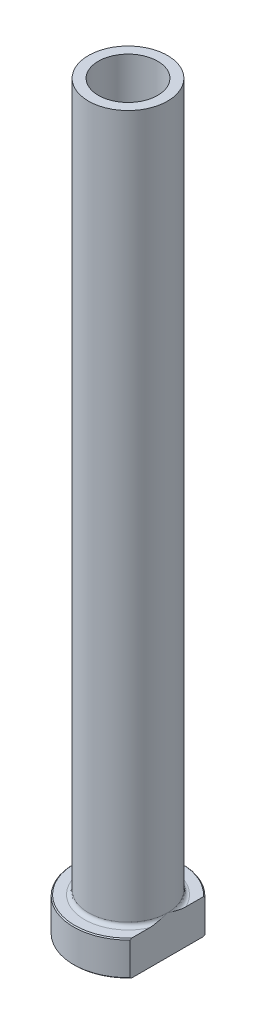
ISO-10303-21;
HEADER;
FILE_DESCRIPTION(('STEP AP214'),'2;1');
FILE_NAME('part.step','',(''),(''),'','','');
FILE_SCHEMA(('AUTOMOTIVE_DESIGN { 1 0 10303 214 1 1 1 1 }'));
ENDSEC;
DATA;
#1=APPLICATION_CONTEXT('core data for automotive mechanical design processes');
#2=APPLICATION_PROTOCOL_DEFINITION('international standard','automotive_design',2000,#1);
#3=PRODUCT_CONTEXT('',#1,'mechanical');
#4=PRODUCT('Part','Part','',(#3));
#5=PRODUCT_RELATED_PRODUCT_CATEGORY('part','',(#4));
#6=PRODUCT_DEFINITION_FORMATION('','',#4);
#7=PRODUCT_DEFINITION_CONTEXT('part definition',#1,'design');
#8=PRODUCT_DEFINITION('design','',#6,#7);
#9=PRODUCT_DEFINITION_SHAPE('','',#8);
#10=(LENGTH_UNIT() NAMED_UNIT(*) SI_UNIT(.MILLI.,.METRE.));
#11=(NAMED_UNIT(*) PLANE_ANGLE_UNIT() SI_UNIT($,.RADIAN.));
#12=(NAMED_UNIT(*) SI_UNIT($,.STERADIAN.) SOLID_ANGLE_UNIT());
#13=UNCERTAINTY_MEASURE_WITH_UNIT(LENGTH_MEASURE(1.E-05),#10,'distance_accuracy_value','');
#14=(GEOMETRIC_REPRESENTATION_CONTEXT(3) GLOBAL_UNCERTAINTY_ASSIGNED_CONTEXT((#13)) GLOBAL_UNIT_ASSIGNED_CONTEXT((#10,
#11,#12)) REPRESENTATION_CONTEXT('',''));
#15=CARTESIAN_POINT('',(0.,0.,0.));
#16=DIRECTION('',(0.,0.,1.));
#17=DIRECTION('',(1.,0.,0.));
#18=AXIS2_PLACEMENT_3D('',#15,#16,#17);
#19=CARTESIAN_POINT('',(0.,92.1876809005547,0.));
#20=DIRECTION('',(0.,1.,0.));
#21=DIRECTION('',(0.,0.,1.));
#22=AXIS2_PLACEMENT_3D('',#19,#20,#21);
#23=CYLINDRICAL_SURFACE('',#22,6.);
#24=CARTESIAN_POINT('',(0.,150.,0.));
#25=DIRECTION('',(0.,1.,0.));
#26=DIRECTION('',(0.,0.,1.));
#27=AXIS2_PLACEMENT_3D('',#24,#25,#26);
#28=CIRCLE('',#27,6.);
#29=CARTESIAN_POINT('',(0.,150.,6.));
#30=VERTEX_POINT('',#29);
#31=EDGE_CURVE('E167',#30,#30,#28,.T.);
#32=ORIENTED_EDGE('',*,*,#31,.T.);
#33=EDGE_LOOP('',(#32));
#34=FACE_BOUND('',#33,.T.);
#35=CARTESIAN_POINT('',(0.,95.,0.));
#36=DIRECTION('',(0.,1.,0.));
#37=DIRECTION('',(0.,0.,1.));
#38=AXIS2_PLACEMENT_3D('',#35,#36,#37);
#39=CIRCLE('',#38,6.);
#40=CARTESIAN_POINT('',(0.,95.,6.));
#41=VERTEX_POINT('',#40);
#42=EDGE_CURVE('E170',#41,#41,#39,.T.);
#43=ORIENTED_EDGE('',*,*,#42,.F.);
#44=EDGE_LOOP('',(#43));
#45=FACE_BOUND('',#44,.T.);
#46=ADVANCED_FACE('F32',(#34,#45),#23,.F.);
#47=CARTESIAN_POINT('',(-6.,150.,0.));
#48=DIRECTION('',(0.,1.,0.));
#49=DIRECTION('',(0.,0.,1.));
#50=AXIS2_PLACEMENT_3D('',#47,#48,#49);
#51=PLANE('',#50);
#52=CARTESIAN_POINT('',(0.,150.,0.));
#53=DIRECTION('',(0.,1.,0.));
#54=DIRECTION('',(0.,0.,1.));
#55=AXIS2_PLACEMENT_3D('',#52,#53,#54);
#56=CIRCLE('',#55,8.00000000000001);
#57=CARTESIAN_POINT('',(0.,150.,8.00000000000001));
#58=VERTEX_POINT('',#57);
#59=EDGE_CURVE('E174',#58,#58,#56,.T.);
#60=ORIENTED_EDGE('',*,*,#59,.T.);
#61=EDGE_LOOP('',(#60));
#62=FACE_BOUND('',#61,.T.);
#63=ORIENTED_EDGE('',*,*,#31,.F.);
#64=EDGE_LOOP('',(#63));
#65=FACE_BOUND('',#64,.T.);
#66=ADVANCED_FACE('F157',(#62,#65),#51,.T.);
#67=CARTESIAN_POINT('',(0.,92.1876809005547,0.));
#68=DIRECTION('',(0.,1.,0.));
#69=DIRECTION('',(0.,0.,1.));
#70=AXIS2_PLACEMENT_3D('',#67,#68,#69);
#71=CYLINDRICAL_SURFACE('',#70,8.);
#72=CARTESIAN_POINT('',(0.,7.8,0.));
#73=DIRECTION('',(0.,1.,0.));
#74=DIRECTION('',(0.,0.,1.));
#75=AXIS2_PLACEMENT_3D('',#72,#73,#74);
#76=CIRCLE('',#75,8.);
#77=CARTESIAN_POINT('',(8.,7.8,0.));
#78=VERTEX_POINT('',#77);
#79=EDGE_CURVE('E180',#78,#78,#76,.T.);
#80=ORIENTED_EDGE('',*,*,#79,.T.);
#81=EDGE_LOOP('',(#80));
#82=FACE_BOUND('',#81,.T.);
#83=ORIENTED_EDGE('',*,*,#59,.F.);
#84=EDGE_LOOP('',(#83));
#85=FACE_BOUND('',#84,.T.);
#86=ADVANCED_FACE('F162',(#82,#85),#71,.T.);
#87=CARTESIAN_POINT('',(-7.99999999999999,7.,0.));
#88=DIRECTION('',(0.,1.,0.));
#89=DIRECTION('',(0.,0.,1.));
#90=AXIS2_PLACEMENT_3D('',#87,#88,#89);
#91=PLANE('',#90);
#92=DIRECTION('',(0.,0.,1.));
#93=VECTOR('',#92,1.);
#94=CARTESIAN_POINT('',(8.,7.,0.));
#95=LINE('',#94,#93);
#96=CARTESIAN_POINT('',(8.,7.,-7.25534285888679));
#97=VERTEX_POINT('',#96);
#98=CARTESIAN_POINT('',(8.,7.,-3.66606055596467));
#99=VERTEX_POINT('',#98);
#100=EDGE_CURVE('E54',#97,#99,#95,.T.);
#101=ORIENTED_EDGE('',*,*,#100,.F.);
#102=CARTESIAN_POINT('',(0.,7.,0.));
#103=DIRECTION('',(0.,1.,0.));
#104=DIRECTION('',(0.,0.,1.));
#105=AXIS2_PLACEMENT_3D('',#102,#103,#104);
#106=CIRCLE('',#105,10.8);
#107=CARTESIAN_POINT('',(8.,7.,7.2553428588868));
#108=VERTEX_POINT('',#107);
#109=EDGE_CURVE('E186',#97,#108,#106,.T.);
#110=ORIENTED_EDGE('',*,*,#109,.T.);
#111=CARTESIAN_POINT('',(8.,7.,3.66606055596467));
#112=VERTEX_POINT('',#111);
#113=EDGE_CURVE('E134',#112,#108,#95,.T.);
#114=ORIENTED_EDGE('',*,*,#113,.F.);
#115=CARTESIAN_POINT('',(0.,7.,0.));
#116=DIRECTION('',(0.,1.,0.));
#117=DIRECTION('',(0.,0.,1.));
#118=AXIS2_PLACEMENT_3D('',#115,#116,#117);
#119=CIRCLE('',#118,8.8);
#120=EDGE_CURVE('E183',#112,#99,#119,.F.);
#121=ORIENTED_EDGE('',*,*,#120,.T.);
#122=EDGE_LOOP('',(#101,#110,#114,#121));
#123=FACE_BOUND('',#122,.T.);
#124=ADVANCED_FACE('F197',(#123),#91,.T.);
#125=CARTESIAN_POINT('',(0.,92.1876809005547,0.));
#126=DIRECTION('',(0.,1.,0.));
#127=DIRECTION('',(0.,0.,1.));
#128=AXIS2_PLACEMENT_3D('',#125,#126,#127);
#129=CYLINDRICAL_SURFACE('',#128,11.);
#130=DIRECTION('',(0.,-1.,0.));
#131=VECTOR('',#130,1.);
#132=CARTESIAN_POINT('',(8.,150.,7.54983443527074));
#133=LINE('',#132,#131);
#134=CARTESIAN_POINT('',(8.,6.79999999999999,7.54983443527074));
#135=VERTEX_POINT('',#134);
#136=CARTESIAN_POINT('',(8.,0.200000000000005,7.54983443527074));
#137=VERTEX_POINT('',#136);
#138=EDGE_CURVE('E82',#135,#137,#133,.T.);
#139=ORIENTED_EDGE('',*,*,#138,.F.);
#140=CARTESIAN_POINT('',(0.,6.79999999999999,0.));
#141=DIRECTION('',(0.,1.,0.));
#142=DIRECTION('',(0.,0.,1.));
#143=AXIS2_PLACEMENT_3D('',#140,#141,#142);
#144=CIRCLE('',#143,11.);
#145=CARTESIAN_POINT('',(8.,6.79999999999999,-7.54983443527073));
#146=VERTEX_POINT('',#145);
#147=EDGE_CURVE('E95',#135,#146,#144,.F.);
#148=ORIENTED_EDGE('',*,*,#147,.T.);
#149=DIRECTION('',(0.,-1.,0.));
#150=VECTOR('',#149,1.);
#151=CARTESIAN_POINT('',(8.,150.,-7.54983443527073));
#152=LINE('',#151,#150);
#153=CARTESIAN_POINT('',(8.,0.200000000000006,-7.54983443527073));
#154=VERTEX_POINT('',#153);
#155=EDGE_CURVE('E192',#146,#154,#152,.T.);
#156=ORIENTED_EDGE('',*,*,#155,.T.);
#157=CARTESIAN_POINT('',(0.,0.200000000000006,0.));
#158=DIRECTION('',(0.,-1.,0.));
#159=DIRECTION('',(0.,0.,-1.));
#160=AXIS2_PLACEMENT_3D('',#157,#158,#159);
#161=CIRCLE('',#160,11.);
#162=EDGE_CURVE('E98',#154,#137,#161,.F.);
#163=ORIENTED_EDGE('',*,*,#162,.T.);
#164=EDGE_LOOP('',(#139,#148,#156,#163));
#165=FACE_BOUND('',#164,.T.);
#166=ADVANCED_FACE('F190',(#165),#129,.T.);
#167=CARTESIAN_POINT('',(-11.,0.,0.));
#168=DIRECTION('',(0.,-1.,0.));
#169=DIRECTION('',(0.,0.,-1.));
#170=AXIS2_PLACEMENT_3D('',#167,#168,#169);
#171=PLANE('',#170);
#172=CARTESIAN_POINT('',(0.,0.,0.));
#173=DIRECTION('',(0.,-1.,0.));
#174=DIRECTION('',(0.,0.,-1.));
#175=AXIS2_PLACEMENT_3D('',#172,#173,#174);
#176=CIRCLE('',#175,6.74999999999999);
#177=CARTESIAN_POINT('',(0.,0.,-6.74999999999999));
#178=VERTEX_POINT('',#177);
#179=EDGE_CURVE('E40',#178,#178,#176,.F.);
#180=ORIENTED_EDGE('',*,*,#179,.T.);
#181=EDGE_LOOP('',(#180));
#182=FACE_BOUND('',#181,.T.);
#183=DIRECTION('',(0.,0.,-1.));
#184=VECTOR('',#183,1.);
#185=CARTESIAN_POINT('',(8.,0.,7.54983443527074));
#186=LINE('',#185,#184);
#187=CARTESIAN_POINT('',(8.,0.,7.25534285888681));
#188=VERTEX_POINT('',#187);
#189=CARTESIAN_POINT('',(8.,0.,-7.25534285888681));
#190=VERTEX_POINT('',#189);
#191=EDGE_CURVE('E47',#188,#190,#186,.T.);
#192=ORIENTED_EDGE('',*,*,#191,.F.);
#193=CARTESIAN_POINT('',(0.,0.,0.));
#194=DIRECTION('',(0.,-1.,0.));
#195=DIRECTION('',(0.,0.,-1.));
#196=AXIS2_PLACEMENT_3D('',#193,#194,#195);
#197=CIRCLE('',#196,10.8);
#198=EDGE_CURVE('E92',#188,#190,#197,.T.);
#199=ORIENTED_EDGE('',*,*,#198,.T.);
#200=EDGE_LOOP('',(#192,#199));
#201=FACE_BOUND('',#200,.T.);
#202=ADVANCED_FACE('F91',(#182,#201),#171,.T.);
#203=CARTESIAN_POINT('',(0.,92.1876809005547,0.));
#204=DIRECTION('',(0.,1.,0.));
#205=DIRECTION('',(0.,0.,1.));
#206=AXIS2_PLACEMENT_3D('',#203,#204,#205);
#207=CYLINDRICAL_SURFACE('',#206,6.25);
#208=CARTESIAN_POINT('',(0.,0.499999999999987,0.));
#209=DIRECTION('',(0.,-1.,0.));
#210=DIRECTION('',(0.,0.,-1.));
#211=AXIS2_PLACEMENT_3D('',#208,#209,#210);
#212=CIRCLE('',#211,6.25);
#213=CARTESIAN_POINT('',(0.,0.499999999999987,-6.25));
#214=VERTEX_POINT('',#213);
#215=EDGE_CURVE('E11',#214,#214,#212,.T.);
#216=ORIENTED_EDGE('',*,*,#215,.T.);
#217=EDGE_LOOP('',(#216));
#218=FACE_BOUND('',#217,.T.);
#219=CARTESIAN_POINT('',(0.,83.,0.));
#220=DIRECTION('',(0.,1.,0.));
#221=DIRECTION('',(0.,0.,1.));
#222=AXIS2_PLACEMENT_3D('',#219,#220,#221);
#223=CIRCLE('',#222,6.25);
#224=CARTESIAN_POINT('',(0.,83.,6.25));
#225=VERTEX_POINT('',#224);
#226=EDGE_CURVE('E172',#225,#225,#223,.T.);
#227=ORIENTED_EDGE('',*,*,#226,.T.);
#228=EDGE_LOOP('',(#227));
#229=FACE_BOUND('',#228,.T.);
#230=ADVANCED_FACE('F215',(#218,#229),#207,.F.);
#231=CARTESIAN_POINT('',(0.,83.,0.));
#232=DIRECTION('',(0.,-1.,0.));
#233=DIRECTION('',(0.,0.,-1.));
#234=AXIS2_PLACEMENT_3D('',#231,#232,#233);
#235=CONICAL_SURFACE('',#234,6.25,0.0208303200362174);
#236=ORIENTED_EDGE('',*,*,#42,.T.);
#237=EDGE_LOOP('',(#236));
#238=FACE_BOUND('',#237,.T.);
#239=ORIENTED_EDGE('',*,*,#226,.F.);
#240=EDGE_LOOP('',(#239));
#241=FACE_BOUND('',#240,.T.);
#242=ADVANCED_FACE('F111',(#238,#241),#235,.F.);
#243=CARTESIAN_POINT('',(0.,7.8,0.));
#244=DIRECTION('',(0.,1.,0.));
#245=DIRECTION('',(0.,0.,1.));
#246=AXIS2_PLACEMENT_3D('',#243,#244,#245);
#247=TOROIDAL_SURFACE('',#246,8.8,0.8);
#248=ORIENTED_EDGE('',*,*,#120,.F.);
#249=CARTESIAN_POINT('',(8.,7.8,0.));
#250=CARTESIAN_POINT('',(8.,7.80000101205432,-1.09624618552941E-10));
#251=CARTESIAN_POINT('',(8.,7.80000202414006,2.93324102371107E-07));
#252=CARTESIAN_POINT('',(8.,7.80000394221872,1.16283092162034E-06));
#253=CARTESIAN_POINT('',(8.,7.80000483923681,1.75365137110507E-06));
#254=CARTESIAN_POINT('',(8.,7.80000665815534,3.16446778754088E-06));
#255=CARTESIAN_POINT('',(8.,7.80000756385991,4.00549161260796E-06));
#256=CARTESIAN_POINT('',(8.,7.80000923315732,5.783479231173E-06));
#257=CARTESIAN_POINT('',(8.,7.80000999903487,6.71842031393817E-06));
#258=CARTESIAN_POINT('',(8.,7.80001270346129,1.02037216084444E-05));
#259=CARTESIAN_POINT('',(8.,7.80001449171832,1.2874040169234E-05));
#260=CARTESIAN_POINT('',(8.,7.80001755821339,1.82727385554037E-05));
#261=CARTESIAN_POINT('',(8.,7.80001886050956,2.09881557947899E-05));
#262=CARTESIAN_POINT('',(8.,7.80002405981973,3.20647804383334E-05));
#263=CARTESIAN_POINT('',(8.,7.80002777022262,4.05225585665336E-05));
#264=CARTESIAN_POINT('',(8.,7.80003348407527,5.68037702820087E-05));
#265=CARTESIAN_POINT('',(8.,7.80003564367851,6.4572887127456E-05));
#266=CARTESIAN_POINT('',(8.,7.800050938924,0.000121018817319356));
#267=CARTESIAN_POINT('',(8.,7.80006211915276,0.000170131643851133));
#268=CARTESIAN_POINT('',(7.99999999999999,7.80011100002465,0.000362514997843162));
#269=CARTESIAN_POINT('',(8.,7.80015802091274,0.000503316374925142));
#270=CARTESIAN_POINT('',(8.00000000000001,7.80033939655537,0.00105711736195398));
#271=CARTESIAN_POINT('',(8.,7.80046737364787,0.00147161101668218));
#272=CARTESIAN_POINT('',(7.99999999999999,7.80097644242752,0.00310648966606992));
#273=CARTESIAN_POINT('',(7.99999999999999,7.80136531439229,0.00432501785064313));
#274=CARTESIAN_POINT('',(8.00000000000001,7.80297358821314,0.00937955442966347));
#275=CARTESIAN_POINT('',(8.,7.80418342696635,0.0132178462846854));
#276=CARTESIAN_POINT('',(7.99999999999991,7.82754122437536,0.0873020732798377));
#277=CARTESIAN_POINT('',(7.99999999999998,7.84979021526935,0.157524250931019));
#278=CARTESIAN_POINT('',(8.00000000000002,7.89322681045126,0.295235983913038));
#279=CARTESIAN_POINT('',(8.,7.91442151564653,0.362723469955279));
#280=CARTESIAN_POINT('',(7.99999999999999,7.9592343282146,0.506178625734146));
#281=CARTESIAN_POINT('',(8.,7.9828252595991,0.582154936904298));
#282=CARTESIAN_POINT('',(8.,8.02983069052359,0.735069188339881));
#283=CARTESIAN_POINT('',(8.,8.05324046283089,0.812008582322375));
#284=CARTESIAN_POINT('',(8.,8.09303795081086,0.94464550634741));
#285=CARTESIAN_POINT('',(8.,8.10956807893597,1.00030022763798));
#286=CARTESIAN_POINT('',(8.,8.14221289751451,1.11157683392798));
#287=CARTESIAN_POINT('',(8.,8.15832854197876,1.16719843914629));
#288=CARTESIAN_POINT('',(8.,8.20527739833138,1.33164052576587));
#289=CARTESIAN_POINT('',(8.,8.23549814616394,1.44063711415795));
#290=CARTESIAN_POINT('',(8.,8.29826335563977,1.67606835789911));
#291=CARTESIAN_POINT('',(8.,8.3304474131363,1.80259995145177));
#292=CARTESIAN_POINT('',(8.,8.39126396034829,2.05750030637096));
#293=CARTESIAN_POINT('',(8.,8.41986879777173,2.18587573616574));
#294=CARTESIAN_POINT('',(8.,8.47414203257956,2.4532187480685));
#295=CARTESIAN_POINT('',(8.,8.49943375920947,2.59226394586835));
#296=CARTESIAN_POINT('',(8.,8.54278750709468,2.87150561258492));
#297=CARTESIAN_POINT('',(8.,8.56085024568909,3.01170196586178));
#298=CARTESIAN_POINT('',(8.,8.58291287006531,3.24319459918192));
#299=CARTESIAN_POINT('',(8.,8.589627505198,3.33423069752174));
#300=CARTESIAN_POINT('',(8.,8.59844042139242,3.51651109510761));
#301=CARTESIAN_POINT('',(8.,8.60054027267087,3.60775531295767));
#302=CARTESIAN_POINT('',(8.,8.59923478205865,3.78855451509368));
#303=CARTESIAN_POINT('',(8.,8.59592927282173,3.87810991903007));
#304=CARTESIAN_POINT('',(8.,8.58288784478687,4.05671727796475));
#305=CARTESIAN_POINT('',(8.,8.57315718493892,4.14576958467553));
#306=CARTESIAN_POINT('',(8.,8.54786053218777,4.30910044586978));
#307=CARTESIAN_POINT('',(8.,8.53341905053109,4.38354919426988));
#308=CARTESIAN_POINT('',(8.,8.49747543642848,4.53120906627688));
#309=CARTESIAN_POINT('',(8.,8.47593618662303,4.60441150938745));
#310=CARTESIAN_POINT('',(8.,8.42376924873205,4.74853436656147));
#311=CARTESIAN_POINT('',(8.,8.39303920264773,4.81941853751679));
#312=CARTESIAN_POINT('',(8.,8.32008168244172,4.9549058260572));
#313=CARTESIAN_POINT('',(8.,8.27792970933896,5.01954653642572));
#314=CARTESIAN_POINT('',(8.,8.20692535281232,5.10354772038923));
#315=CARTESIAN_POINT('',(8.,8.1839783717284,5.1278859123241));
#316=CARTESIAN_POINT('',(8.,8.13503511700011,5.17336988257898));
#317=CARTESIAN_POINT('',(8.,8.10903727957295,5.19451401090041));
#318=CARTESIAN_POINT('',(8.,8.05362521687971,5.23266411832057));
#319=CARTESIAN_POINT('',(8.,8.02417247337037,5.2496152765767));
#320=CARTESIAN_POINT('',(8.,7.96255238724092,5.27751973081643));
#321=CARTESIAN_POINT('',(8.,7.93039220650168,5.28848831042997));
#322=CARTESIAN_POINT('',(8.,7.87282733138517,5.30129051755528));
#323=CARTESIAN_POINT('',(8.,7.84777777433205,5.3047353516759));
#324=CARTESIAN_POINT('',(8.,7.79745799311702,5.30730687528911));
#325=CARTESIAN_POINT('',(8.,7.77218785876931,5.30643524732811));
#326=CARTESIAN_POINT('',(8.,7.72220872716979,5.30045124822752));
#327=CARTESIAN_POINT('',(8.,7.69749884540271,5.29534612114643));
#328=CARTESIAN_POINT('',(8.,7.64919855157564,5.28130622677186));
#329=CARTESIAN_POINT('',(8.,7.62560888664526,5.27236894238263));
#330=CARTESIAN_POINT('',(8.,7.57186978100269,5.24749103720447));
#331=CARTESIAN_POINT('',(8.,7.54235117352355,5.2301914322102));
#332=CARTESIAN_POINT('',(8.,7.48647501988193,5.19107874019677));
#333=CARTESIAN_POINT('',(8.,7.46012476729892,5.16925554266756));
#334=CARTESIAN_POINT('',(8.,7.397581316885,5.11005232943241));
#335=CARTESIAN_POINT('',(8.,7.3634525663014,5.07050732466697));
#336=CARTESIAN_POINT('',(8.,7.30158414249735,4.98680536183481));
#337=CARTESIAN_POINT('',(8.,7.27385227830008,4.94264286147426));
#338=CARTESIAN_POINT('',(8.,7.22655631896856,4.85651446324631));
#339=CARTESIAN_POINT('',(8.,7.2064260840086,4.81485346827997));
#340=CARTESIAN_POINT('',(8.,7.16979237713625,4.72995016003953));
#341=CARTESIAN_POINT('',(8.,7.15329194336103,4.6867065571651));
#342=CARTESIAN_POINT('',(8.,7.1082475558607,4.55471342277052));
#343=CARTESIAN_POINT('',(8.,7.08448205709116,4.46433285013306));
#344=CARTESIAN_POINT('',(8.,7.04606817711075,4.27884520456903));
#345=CARTESIAN_POINT('',(8.,7.03172934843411,4.18367881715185));
#346=CARTESIAN_POINT('',(8.,7.01115182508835,3.99231790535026));
#347=CARTESIAN_POINT('',(8.,7.00492963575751,3.89612168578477));
#348=CARTESIAN_POINT('',(8.,6.99917472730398,3.7068320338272));
#349=CARTESIAN_POINT('',(8.,6.99942213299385,3.61374410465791));
#350=CARTESIAN_POINT('',(8.,7.00500334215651,3.42814181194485));
#351=CARTESIAN_POINT('',(8.,7.01031504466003,3.3356267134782));
#352=CARTESIAN_POINT('',(8.,7.02729273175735,3.12465235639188));
#353=CARTESIAN_POINT('',(8.,7.04033732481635,3.00630616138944));
#354=CARTESIAN_POINT('',(8.,7.07206018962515,2.77043320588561));
#355=CARTESIAN_POINT('',(8.,7.09073668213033,2.65290619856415));
#356=CARTESIAN_POINT('',(8.,7.13314336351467,2.4159831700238));
#357=CARTESIAN_POINT('',(8.,7.15698005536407,2.29660645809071));
#358=CARTESIAN_POINT('',(8.,7.2085650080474,2.05839418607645));
#359=CARTESIAN_POINT('',(8.,7.23632304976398,1.93956077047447));
#360=CARTESIAN_POINT('',(8.,7.30538420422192,1.6602675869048));
#361=CARTESIAN_POINT('',(8.,7.34797978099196,1.50012949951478));
#362=CARTESIAN_POINT('',(8.,7.43661699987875,1.18271330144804));
#363=CARTESIAN_POINT('',(8.,7.48261587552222,1.02542306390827));
#364=CARTESIAN_POINT('',(8.,7.55073856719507,0.798945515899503));
#365=CARTESIAN_POINT('',(8.,7.57189590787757,0.729464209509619));
#366=CARTESIAN_POINT('',(8.,7.6146616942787,0.590318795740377));
#367=CARTESIAN_POINT('',(8.,7.63627166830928,0.520655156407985));
#368=CARTESIAN_POINT('',(8.,7.68075896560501,0.378072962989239));
#369=CARTESIAN_POINT('',(8.00000000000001,7.70364749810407,0.305157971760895));
#370=CARTESIAN_POINT('',(7.99999999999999,7.74926260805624,0.160522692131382));
#371=CARTESIAN_POINT('',(7.99999999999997,7.77198614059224,0.0888015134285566));
#372=CARTESIAN_POINT('',(8.,7.79581756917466,0.0132146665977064));
#373=CARTESIAN_POINT('',(8.,7.79702841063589,0.00937319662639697));
#374=CARTESIAN_POINT('',(8.,7.7986369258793,0.00431792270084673));
#375=CARTESIAN_POINT('',(8.,7.7990250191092,0.00310183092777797));
#376=CARTESIAN_POINT('',(8.,7.79953313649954,0.00147000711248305));
#377=CARTESIAN_POINT('',(8.,7.79966092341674,0.00105612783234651));
#378=CARTESIAN_POINT('',(8.,7.79984206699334,0.000503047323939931));
#379=CARTESIAN_POINT('',(8.,7.79988905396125,0.000362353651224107));
#380=CARTESIAN_POINT('',(8.,7.79993790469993,0.000170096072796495));
#381=CARTESIAN_POINT('',(8.,7.79994908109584,0.000120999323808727));
#382=CARTESIAN_POINT('',(8.,7.79996436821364,6.45695800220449E-05));
#383=CARTESIAN_POINT('',(8.,7.79996652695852,5.68014469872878E-05));
#384=CARTESIAN_POINT('',(8.,7.7999722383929,4.05221695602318E-05));
#385=CARTESIAN_POINT('',(8.,7.79997594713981,3.20652918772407E-05));
#386=CARTESIAN_POINT('',(8.,7.79998114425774,2.09895698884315E-05));
#387=CARTESIAN_POINT('',(8.,7.79998244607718,1.8274226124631E-05));
#388=CARTESIAN_POINT('',(8.,7.7999855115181,1.28755885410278E-05));
#389=CARTESIAN_POINT('',(8.,7.79998729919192,1.02052498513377E-05));
#390=CARTESIAN_POINT('',(8.,7.79999000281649,6.71981854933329E-06));
#391=CARTESIAN_POINT('',(8.,7.79999076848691,5.78481784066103E-06));
#392=CARTESIAN_POINT('',(8.,7.79999243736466,4.00667365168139E-06));
#393=CARTESIAN_POINT('',(8.,7.79999334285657,3.16555205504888E-06));
#394=CARTESIAN_POINT('',(8.,7.79999516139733,1.75450218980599E-06));
#395=CARTESIAN_POINT('',(8.,7.79999605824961,1.16355303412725E-06));
#396=CARTESIAN_POINT('',(8.,7.79999797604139,2.93728190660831E-07));
#397=CARTESIAN_POINT('',(8.,7.79999898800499,1.096218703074E-10));
#398=CARTESIAN_POINT('',(8.,7.8,0.));
#399=B_SPLINE_CURVE_WITH_KNOTS('',3,(#249,#250,#251,#252,#253,#254,#255,#256,#257,#258,#259,
#260,#261,#262,#263,#264,#265,#266,#267,#268,#269,#270,#271,#272,#273,#274,#275,#276,#277,#278,
#279,#280,#281,#282,#283,#284,#285,#286,#287,#288,#289,#290,#291,#292,#293,#294,#295,#296,#297,
#298,#299,#300,#301,#302,#303,#304,#305,#306,#307,#308,#309,#310,#311,#312,#313,#314,#315,#316,
#317,#318,#319,#320,#321,#322,#323,#324,#325,#326,#327,#328,#329,#330,#331,#332,#333,#334,#335,
#336,#337,#338,#339,#340,#341,#342,#343,#344,#345,#346,#347,#348,#349,#350,#351,#352,#353,#354,
#355,#356,#357,#358,#359,#360,#361,#362,#363,#364,#365,#366,#367,#368,#369,#370,#371,#372,#373,
#374,#375,#376,#377,#378,#379,#380,#381,#382,#383,#384,#385,#386,#387,#388,#389,#390,#391,#392,
#393,#394,#395,#396,#397,#398),.UNSPECIFIED.,.T.,.F.,(4,2,2,2,2,2,2,2,2,2,2,2,2,2,2,2,2,2,2,2,2,
2,2,2,2,2,2,2,2,2,2,2,2,2,2,2,2,2,2,2,2,2,2,2,2,2,2,2,2,2,2,2,2,2,2,2,2,2,2,2,2,2,2,2,2,2,2,2,2,
2,2,2,2,2,4),(0.,3.04287595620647E-06,6.25420232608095E-06,9.9438658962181E-06,
1.35664352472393E-05,2.31665055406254E-05,3.21939848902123E-05,5.98353431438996E-05,
8.39944725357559E-05,0.000235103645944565,0.000679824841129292,0.00198183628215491,
0.00581831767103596,0.0178924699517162,0.238870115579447,0.451084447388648,0.689746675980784,
0.931010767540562,1.10518257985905,1.27890913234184,1.61821807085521,2.00985537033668,
2.40435266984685,2.82819297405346,3.25199120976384,3.52574836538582,3.79941235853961,
4.06807884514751,4.33652570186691,4.56378083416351,4.79224376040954,5.0233523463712,
5.25296903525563,5.35309534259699,5.45327319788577,5.55469877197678,5.65586400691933,
5.7313736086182,5.80685377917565,5.88220505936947,5.95760590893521,6.05967508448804,
6.16197489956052,6.31780492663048,6.47382418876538,6.61243130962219,6.75115400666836,
7.0307026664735,7.31902502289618,7.6079327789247,7.88703491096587,8.1649245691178,
8.52193605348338,8.87883486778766,9.24395493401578,9.61000233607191,10.1070420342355,
10.5986476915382,10.8165407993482,11.0353545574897,11.2646261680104,11.4903206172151,
11.5024047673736,11.5062335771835,11.5075336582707,11.5079780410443,11.5081291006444,
11.5081532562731,11.5081808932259,11.5081899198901,11.5081995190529,11.5082031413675,
11.5082068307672,11.5082100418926,11.5082130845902),.UNSPECIFIED.);
#400=EDGE_CURVE('E126',#112,#78,#399,.T.);
#401=ORIENTED_EDGE('',*,*,#400,.T.);
#402=ORIENTED_EDGE('',*,*,#79,.F.);
#403=CARTESIAN_POINT('',(8.,7.8,0.));
#404=CARTESIAN_POINT('',(8.,7.79999898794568,1.09628424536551E-10));
#405=CARTESIAN_POINT('',(8.,7.79999797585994,-2.93324098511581E-07));
#406=CARTESIAN_POINT('',(8.,7.79999605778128,-1.16283091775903E-06));
#407=CARTESIAN_POINT('',(8.,7.79999516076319,-1.75365136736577E-06));
#408=CARTESIAN_POINT('',(8.,7.79999334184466,-3.16446778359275E-06));
#409=CARTESIAN_POINT('',(8.,7.79999243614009,-4.00549160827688E-06));
#410=CARTESIAN_POINT('',(8.,7.79999076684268,-5.7834792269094E-06));
#411=CARTESIAN_POINT('',(8.,7.79999000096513,-6.71842031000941E-06));
#412=CARTESIAN_POINT('',(8.,7.79998729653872,-1.02037216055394E-05));
#413=CARTESIAN_POINT('',(8.,7.79998550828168,-1.28740401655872E-05));
#414=CARTESIAN_POINT('',(8.,7.79998244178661,-1.82727385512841E-05));
#415=CARTESIAN_POINT('',(8.,7.79998113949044,-2.09881557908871E-05));
#416=CARTESIAN_POINT('',(8.,7.79997594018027,-3.20647804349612E-05));
#417=CARTESIAN_POINT('',(8.,7.79997222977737,-4.05225585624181E-05));
#418=CARTESIAN_POINT('',(8.,7.79996651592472,-5.68037702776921E-05));
#419=CARTESIAN_POINT('',(8.,7.79996435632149,-6.45728871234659E-05));
#420=CARTESIAN_POINT('',(8.,7.79994906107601,-0.000121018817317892));
#421=CARTESIAN_POINT('',(8.,7.79993788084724,-0.000170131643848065));
#422=CARTESIAN_POINT('',(7.99999999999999,7.79988899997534,-0.000362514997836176));
#423=CARTESIAN_POINT('',(8.,7.79984197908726,-0.000503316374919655));
#424=CARTESIAN_POINT('',(8.00000000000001,7.79966060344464,-0.00105711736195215));
#425=CARTESIAN_POINT('',(8.,7.79953262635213,-0.00147161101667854));
#426=CARTESIAN_POINT('',(7.99999999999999,7.79902355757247,-0.00310648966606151));
#427=CARTESIAN_POINT('',(7.99999999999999,7.7986346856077,-0.0043250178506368));
#428=CARTESIAN_POINT('',(8.00000000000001,7.79702641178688,-0.00937955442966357));
#429=CARTESIAN_POINT('',(8.,7.79581657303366,-0.0132178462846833));
#430=CARTESIAN_POINT('',(7.99999999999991,7.77245877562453,-0.087302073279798));
#431=CARTESIAN_POINT('',(7.99999999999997,7.75020978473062,-0.157524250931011));
#432=CARTESIAN_POINT('',(8.00000000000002,7.70677318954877,-0.295235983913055));
#433=CARTESIAN_POINT('',(8.00000000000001,7.68557848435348,-0.362723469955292));
#434=CARTESIAN_POINT('',(7.99999999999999,7.64076567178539,-0.506178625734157));
#435=CARTESIAN_POINT('',(8.,7.61717474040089,-0.582154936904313));
#436=CARTESIAN_POINT('',(8.,7.5701693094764,-0.7350691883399));
#437=CARTESIAN_POINT('',(8.,7.54675953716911,-0.812008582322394));
#438=CARTESIAN_POINT('',(8.,7.50696204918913,-0.944645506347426));
#439=CARTESIAN_POINT('',(8.,7.49043192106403,-1.00030022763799));
#440=CARTESIAN_POINT('',(8.,7.45778710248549,-1.11157683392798));
#441=CARTESIAN_POINT('',(8.,7.44167145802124,-1.1671984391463));
#442=CARTESIAN_POINT('',(8.,7.39472260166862,-1.33164052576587));
#443=CARTESIAN_POINT('',(8.,7.36450185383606,-1.44063711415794));
#444=CARTESIAN_POINT('',(8.,7.30173664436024,-1.67606835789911));
#445=CARTESIAN_POINT('',(8.,7.2695525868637,-1.80259995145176));
#446=CARTESIAN_POINT('',(8.,7.20873603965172,-2.05750030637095));
#447=CARTESIAN_POINT('',(8.,7.18013120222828,-2.18587573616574));
#448=CARTESIAN_POINT('',(8.,7.12585796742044,-2.45321874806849));
#449=CARTESIAN_POINT('',(8.,7.10056624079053,-2.59226394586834));
#450=CARTESIAN_POINT('',(8.,7.05721249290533,-2.87150561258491));
#451=CARTESIAN_POINT('',(8.,7.03914975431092,-3.01170196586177));
#452=CARTESIAN_POINT('',(8.,7.01708712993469,-3.24319459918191));
#453=CARTESIAN_POINT('',(8.,7.01037249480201,-3.33423069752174));
#454=CARTESIAN_POINT('',(8.,7.00155957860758,-3.51651109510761));
#455=CARTESIAN_POINT('',(8.,6.99945972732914,-3.60775531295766));
#456=CARTESIAN_POINT('',(8.,7.00076521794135,-3.78855451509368));
#457=CARTESIAN_POINT('',(8.,7.00407072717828,-3.87810991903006));
#458=CARTESIAN_POINT('',(8.,7.01711215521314,-4.05671727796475));
#459=CARTESIAN_POINT('',(8.,7.02684281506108,-4.14576958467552));
#460=CARTESIAN_POINT('',(8.,7.05213946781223,-4.30910044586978));
#461=CARTESIAN_POINT('',(8.,7.06658094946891,-4.38354919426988));
#462=CARTESIAN_POINT('',(8.,7.10252456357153,-4.53120906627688));
#463=CARTESIAN_POINT('',(8.,7.12406381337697,-4.60441150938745));
#464=CARTESIAN_POINT('',(8.,7.17623075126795,-4.74853436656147));
#465=CARTESIAN_POINT('',(8.,7.20696079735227,-4.81941853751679));
#466=CARTESIAN_POINT('',(8.,7.27991831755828,-4.9549058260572));
#467=CARTESIAN_POINT('',(8.,7.32207029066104,-5.01954653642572));
#468=CARTESIAN_POINT('',(8.,7.39307464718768,-5.10354772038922));
#469=CARTESIAN_POINT('',(8.,7.4160216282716,-5.1278859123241));
#470=CARTESIAN_POINT('',(8.,7.46496488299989,-5.17336988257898));
#471=CARTESIAN_POINT('',(8.,7.49096272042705,-5.19451401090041));
#472=CARTESIAN_POINT('',(8.,7.5463747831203,-5.23266411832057));
#473=CARTESIAN_POINT('',(8.,7.57582752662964,-5.24961527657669));
#474=CARTESIAN_POINT('',(8.,7.63744761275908,-5.27751973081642));
#475=CARTESIAN_POINT('',(8.,7.66960779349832,-5.28848831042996));
#476=CARTESIAN_POINT('',(8.,7.72717266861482,-5.30129051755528));
#477=CARTESIAN_POINT('',(8.,7.75222222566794,-5.3047353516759));
#478=CARTESIAN_POINT('',(8.,7.80254200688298,-5.30730687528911));
#479=CARTESIAN_POINT('',(8.,7.82781214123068,-5.30643524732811));
#480=CARTESIAN_POINT('',(8.,7.87779127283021,-5.30045124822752));
#481=CARTESIAN_POINT('',(8.,7.90250115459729,-5.29534612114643));
#482=CARTESIAN_POINT('',(8.,7.95080144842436,-5.28130622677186));
#483=CARTESIAN_POINT('',(8.,7.97439111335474,-5.27236894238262));
#484=CARTESIAN_POINT('',(8.,8.02813021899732,-5.24749103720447));
#485=CARTESIAN_POINT('',(8.,8.05764882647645,-5.2301914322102));
#486=CARTESIAN_POINT('',(8.,8.11352498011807,-5.19107874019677));
#487=CARTESIAN_POINT('',(8.,8.13987523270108,-5.16925554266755));
#488=CARTESIAN_POINT('',(8.,8.20241868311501,-5.11005232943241));
#489=CARTESIAN_POINT('',(8.,8.2365474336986,-5.07050732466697));
#490=CARTESIAN_POINT('',(8.,8.29841585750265,-4.98680536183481));
#491=CARTESIAN_POINT('',(8.,8.32614772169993,-4.94264286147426));
#492=CARTESIAN_POINT('',(8.,8.37344368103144,-4.8565144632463));
#493=CARTESIAN_POINT('',(8.,8.39357391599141,-4.81485346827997));
#494=CARTESIAN_POINT('',(8.,8.43020762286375,-4.72995016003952));
#495=CARTESIAN_POINT('',(8.,8.44670805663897,-4.6867065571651));
#496=CARTESIAN_POINT('',(8.,8.49175244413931,-4.55471342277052));
#497=CARTESIAN_POINT('',(8.,8.51551794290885,-4.46433285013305));
#498=CARTESIAN_POINT('',(8.,8.55393182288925,-4.27884520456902));
#499=CARTESIAN_POINT('',(8.,8.56827065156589,-4.18367881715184));
#500=CARTESIAN_POINT('',(8.,8.58884817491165,-3.99231790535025));
#501=CARTESIAN_POINT('',(8.,8.59507036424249,-3.89612168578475));
#502=CARTESIAN_POINT('',(8.,8.60082527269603,-3.70683203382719));
#503=CARTESIAN_POINT('',(8.,8.60057786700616,-3.6137441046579));
#504=CARTESIAN_POINT('',(8.,8.5949966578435,-3.42814181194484));
#505=CARTESIAN_POINT('',(8.,8.58968495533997,-3.33562671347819));
#506=CARTESIAN_POINT('',(8.,8.57270726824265,-3.12465235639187));
#507=CARTESIAN_POINT('',(8.,8.55966267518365,-3.00630616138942));
#508=CARTESIAN_POINT('',(8.,8.52793981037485,-2.77043320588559));
#509=CARTESIAN_POINT('',(8.,8.50926331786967,-2.65290619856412));
#510=CARTESIAN_POINT('',(8.,8.46685663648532,-2.41598317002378));
#511=CARTESIAN_POINT('',(8.,8.44301994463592,-2.29660645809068));
#512=CARTESIAN_POINT('',(8.,8.39143499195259,-2.05839418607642));
#513=CARTESIAN_POINT('',(8.,8.36367695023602,-1.93956077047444));
#514=CARTESIAN_POINT('',(8.,8.29461579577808,-1.66026758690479));
#515=CARTESIAN_POINT('',(8.,8.25202021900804,-1.50012949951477));
#516=CARTESIAN_POINT('',(8.,8.16338300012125,-1.18271330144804));
#517=CARTESIAN_POINT('',(8.,8.11738412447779,-1.02542306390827));
#518=CARTESIAN_POINT('',(8.,8.04926143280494,-0.798945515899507));
#519=CARTESIAN_POINT('',(8.,8.02810409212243,-0.72946420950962));
#520=CARTESIAN_POINT('',(8.,7.9853383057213,-0.590318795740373));
#521=CARTESIAN_POINT('',(8.,7.96372833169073,-0.520655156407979));
#522=CARTESIAN_POINT('',(8.,7.919241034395,-0.378072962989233));
#523=CARTESIAN_POINT('',(8.,7.89635250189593,-0.305157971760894));
#524=CARTESIAN_POINT('',(8.,7.85073739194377,-0.160522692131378));
#525=CARTESIAN_POINT('',(8.,7.82801385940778,-0.0888015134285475));
#526=CARTESIAN_POINT('',(8.,7.80418243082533,-0.0132146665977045));
#527=CARTESIAN_POINT('',(8.,7.8029715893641,-0.00937319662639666));
#528=CARTESIAN_POINT('',(8.,7.80136307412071,-0.00431792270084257));
#529=CARTESIAN_POINT('',(8.,7.80097498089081,-0.00310183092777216));
#530=CARTESIAN_POINT('',(8.,7.80046686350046,-0.00147000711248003));
#531=CARTESIAN_POINT('',(8.,7.80033907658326,-0.00105612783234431));
#532=CARTESIAN_POINT('',(8.,7.80015793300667,-0.000503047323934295));
#533=CARTESIAN_POINT('',(8.,7.80011094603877,-0.000362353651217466));
#534=CARTESIAN_POINT('',(8.,7.80006209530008,-0.000170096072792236));
#535=CARTESIAN_POINT('',(8.,7.80005091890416,-0.000120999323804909));
#536=CARTESIAN_POINT('',(8.,7.80003563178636,-6.45695800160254E-05));
#537=CARTESIAN_POINT('',(8.,7.80003347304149,-5.68014469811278E-05));
#538=CARTESIAN_POINT('',(8.,7.80002776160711,-4.05221695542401E-05));
#539=CARTESIAN_POINT('',(8.,7.80002405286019,-3.20652918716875E-05));
#540=CARTESIAN_POINT('',(8.,7.80001885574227,-2.09895698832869E-05));
#541=CARTESIAN_POINT('',(8.,7.80001755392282,-1.82742261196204E-05));
#542=CARTESIAN_POINT('',(8.,7.8000144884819,-1.28755885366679E-05));
#543=CARTESIAN_POINT('',(8.,7.80001270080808,-1.02052498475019E-05));
#544=CARTESIAN_POINT('',(8.,7.80000999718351,-6.71981854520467E-06));
#545=CARTESIAN_POINT('',(8.,7.8000092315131,-5.78481783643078E-06));
#546=CARTESIAN_POINT('',(8.,7.80000756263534,-4.00667364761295E-06));
#547=CARTESIAN_POINT('',(8.,7.80000665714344,-3.16555205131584E-06));
#548=CARTESIAN_POINT('',(8.,7.80000483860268,-1.7545021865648E-06));
#549=CARTESIAN_POINT('',(8.,7.80000394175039,-1.16355303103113E-06));
#550=CARTESIAN_POINT('',(8.,7.80000202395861,-2.93728187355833E-07));
#551=CARTESIAN_POINT('',(8.,7.80000101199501,-1.09618323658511E-10));
#552=CARTESIAN_POINT('',(8.,7.8,0.));
#553=B_SPLINE_CURVE_WITH_KNOTS('',3,(#403,#404,#405,#406,#407,#408,#409,#410,#411,#412,#413,
#414,#415,#416,#417,#418,#419,#420,#421,#422,#423,#424,#425,#426,#427,#428,#429,#430,#431,#432,
#433,#434,#435,#436,#437,#438,#439,#440,#441,#442,#443,#444,#445,#446,#447,#448,#449,#450,#451,
#452,#453,#454,#455,#456,#457,#458,#459,#460,#461,#462,#463,#464,#465,#466,#467,#468,#469,#470,
#471,#472,#473,#474,#475,#476,#477,#478,#479,#480,#481,#482,#483,#484,#485,#486,#487,#488,#489,
#490,#491,#492,#493,#494,#495,#496,#497,#498,#499,#500,#501,#502,#503,#504,#505,#506,#507,#508,
#509,#510,#511,#512,#513,#514,#515,#516,#517,#518,#519,#520,#521,#522,#523,#524,#525,#526,#527,
#528,#529,#530,#531,#532,#533,#534,#535,#536,#537,#538,#539,#540,#541,#542,#543,#544,#545,#546,
#547,#548,#549,#550,#551,#552),.UNSPECIFIED.,.T.,.F.,(4,2,2,2,2,2,2,2,2,2,2,2,2,2,2,2,2,2,2,2,2,
2,2,2,2,2,2,2,2,2,2,2,2,2,2,2,2,2,2,2,2,2,2,2,2,2,2,2,2,2,2,2,2,2,2,2,2,2,2,2,2,2,2,2,2,2,2,2,2,
2,2,2,2,2,4),(0.,3.04287595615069E-06,6.25420232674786E-06,9.9438658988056E-06,
1.356643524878E-05,2.31665055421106E-05,3.21939848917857E-05,5.98353431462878E-05,
8.39944725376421E-05,0.000235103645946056,0.000679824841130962,0.00198183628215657,
0.00581831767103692,0.0178924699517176,0.238870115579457,0.451084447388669,0.689746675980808,
0.931010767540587,1.10518257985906,1.27890913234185,1.61821807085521,2.00985537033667,
2.40435266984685,2.82819297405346,3.25199120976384,3.52574836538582,3.79941235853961,
4.0680788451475,4.3365257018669,4.56378083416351,4.79224376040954,5.0233523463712,
5.25296903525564,5.353095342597,5.45327319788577,5.55469877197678,5.65586400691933,
5.73137360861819,5.80685377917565,5.88220505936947,5.95760590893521,6.05967508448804,
6.16197489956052,6.31780492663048,6.47382418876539,6.61243130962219,6.75115400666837,
7.03070266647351,7.31902502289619,7.60793277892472,7.88703491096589,8.16492456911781,
8.5219360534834,8.87883486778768,9.24395493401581,9.61000233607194,10.1070420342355,
10.5986476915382,10.8165407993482,11.0353545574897,11.2646261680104,11.4903206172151,
11.5024047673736,11.5062335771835,11.5075336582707,11.5079780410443,11.5081291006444,
11.5081532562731,11.5081808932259,11.5081899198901,11.5081995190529,11.5082031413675,
11.5082068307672,11.5082100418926,11.5082130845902),.UNSPECIFIED.);
#554=EDGE_CURVE('E135',#78,#99,#553,.T.);
#555=ORIENTED_EDGE('',*,*,#554,.T.);
#556=EDGE_LOOP('',(#248,#401,#402,#555));
#557=FACE_BOUND('',#556,.T.);
#558=ADVANCED_FACE('F141',(#557),#247,.F.);
#559=CARTESIAN_POINT('',(0.,7.00000000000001,0.));
#560=DIRECTION('',(0.,-1.,0.));
#561=DIRECTION('',(0.,0.,-1.));
#562=AXIS2_PLACEMENT_3D('',#559,#560,#561);
#563=CONICAL_SURFACE('',#562,10.8,0.785398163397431);
#564=CARTESIAN_POINT('',(8.,-0.636730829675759,-16.6106304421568));
#565=CARTESIAN_POINT('',(8.,-0.41861176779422,-16.3685283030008));
#566=CARTESIAN_POINT('',(8.,-0.200984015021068,-16.1259843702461));
#567=CARTESIAN_POINT('',(8.,0.233148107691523,-15.6398927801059));
#568=CARTESIAN_POINT('',(8.,0.449652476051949,-15.3963451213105));
#569=CARTESIAN_POINT('',(8.,1.09739989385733,-14.6638687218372));
#570=CARTESIAN_POINT('',(8.,1.52674426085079,-14.1732538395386));
#571=CARTESIAN_POINT('',(8.,2.16792810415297,-13.4304656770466));
#572=CARTESIAN_POINT('',(8.,2.38226067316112,-13.1804430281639));
#573=CARTESIAN_POINT('',(8.,2.80892954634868,-12.6787083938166));
#574=CARTESIAN_POINT('',(8.,3.02126589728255,-12.4269964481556));
#575=CARTESIAN_POINT('',(8.,3.44357020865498,-11.9216744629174));
#576=CARTESIAN_POINT('',(8.,3.65353861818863,-11.6680647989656));
#577=CARTESIAN_POINT('',(8.,4.07074862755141,-11.1585723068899));
#578=CARTESIAN_POINT('',(8.,4.27798998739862,-10.9026892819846));
#579=CARTESIAN_POINT('',(8.,4.66965190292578,-10.4127607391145));
#580=CARTESIAN_POINT('',(8.,4.85436868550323,-10.1789522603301));
#581=CARTESIAN_POINT('',(8.,5.22063517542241,-9.70886883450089));
#582=CARTESIAN_POINT('',(8.,5.40218492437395,-9.47259391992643));
#583=CARTESIAN_POINT('',(8.,5.76149237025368,-8.99721569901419));
#584=CARTESIAN_POINT('',(8.,5.93925050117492,-8.75811272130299));
#585=CARTESIAN_POINT('',(8.,6.29022306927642,-8.27660199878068));
#586=CARTESIAN_POINT('',(8.,6.46343768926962,-8.03419438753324));
#587=CARTESIAN_POINT('',(8.,6.80398487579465,-7.5460499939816));
#588=CARTESIAN_POINT('',(8.,6.97132935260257,-7.3003215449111));
#589=CARTESIAN_POINT('',(8.,7.29928849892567,-6.80437777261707));
#590=CARTESIAN_POINT('',(8.,7.45990280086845,-6.55416220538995));
#591=CARTESIAN_POINT('',(8.,7.77264940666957,-6.04873149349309));
#592=CARTESIAN_POINT('',(8.,7.92478824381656,-5.79352041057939));
#593=CARTESIAN_POINT('',(8.,8.21859570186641,-5.27715744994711));
#594=CARTESIAN_POINT('',(8.,8.36026610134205,-5.0160065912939));
#595=CARTESIAN_POINT('',(8.,8.62213596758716,-4.50319242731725));
#596=CARTESIAN_POINT('',(8.,8.74311989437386,-4.2519324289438));
#597=CARTESIAN_POINT('',(8.,8.97065709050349,-3.74287674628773));
#598=CARTESIAN_POINT('',(8.,9.07720941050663,-3.48508063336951));
#599=CARTESIAN_POINT('',(8.,9.27220860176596,-2.96337495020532));
#600=CARTESIAN_POINT('',(8.,9.36069936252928,-2.69948197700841));
#601=CARTESIAN_POINT('',(8.,9.51604316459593,-2.16542713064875));
#602=CARTESIAN_POINT('',(8.,9.58290677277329,-1.89526838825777));
#603=CARTESIAN_POINT('',(8.,9.68291221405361,-1.39216000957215));
#604=CARTESIAN_POINT('',(8.,9.71967474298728,-1.15993430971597));
#605=CARTESIAN_POINT('',(8.,9.77336730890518,-0.693196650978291));
#606=CARTESIAN_POINT('',(8.,9.79030037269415,-0.458685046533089));
#607=CARTESIAN_POINT('',(8.,9.8034285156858,0.0106727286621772));
#608=CARTESIAN_POINT('',(8.,9.79964609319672,0.245518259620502));
#609=CARTESIAN_POINT('',(8.,9.77160926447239,0.713989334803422));
#610=CARTESIAN_POINT('',(8.,9.74735189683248,0.947614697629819));
#611=CARTESIAN_POINT('',(8.,9.67070830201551,1.47287443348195));
#612=CARTESIAN_POINT('',(8.,9.61261890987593,1.76367634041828));
#613=CARTESIAN_POINT('',(8.,9.46982192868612,2.3387328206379));
#614=CARTESIAN_POINT('',(8.,9.38509750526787,2.62298313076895));
#615=CARTESIAN_POINT('',(8.,9.24134311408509,3.04436856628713));
#616=CARTESIAN_POINT('',(8.,9.19048552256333,3.18437323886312));
#617=CARTESIAN_POINT('',(8.,9.08381674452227,3.46241560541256));
#618=CARTESIAN_POINT('',(8.,9.02800782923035,3.60045416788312));
#619=CARTESIAN_POINT('',(8.,8.91195481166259,3.87463242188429));
#620=CARTESIAN_POINT('',(8.,8.85171106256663,4.01077226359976));
#621=CARTESIAN_POINT('',(8.,8.72725899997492,4.2812431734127));
#622=CARTESIAN_POINT('',(8.,8.66305017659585,4.41557400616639));
#623=CARTESIAN_POINT('',(8.,8.48984738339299,4.7659769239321));
#624=CARTESIAN_POINT('',(8.,8.37796178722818,4.98062176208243));
#625=CARTESIAN_POINT('',(8.,8.1464920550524,5.40573762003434));
#626=CARTESIAN_POINT('',(8.,8.02690659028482,5.61620791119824));
#627=CARTESIAN_POINT('',(8.,7.78128707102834,6.03349586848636));
#628=CARTESIAN_POINT('',(8.,7.65524949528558,6.24031145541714));
#629=CARTESIAN_POINT('',(8.,7.39783636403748,6.65060320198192));
#630=CARTESIAN_POINT('',(8.,7.26646042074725,6.85407911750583));
#631=CARTESIAN_POINT('',(8.,6.99890352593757,7.25856399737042));
#632=CARTESIAN_POINT('',(8.,6.86271149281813,7.45956561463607));
#633=CARTESIAN_POINT('',(8.,6.58651908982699,7.85893907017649));
#634=CARTESIAN_POINT('',(8.,6.44651858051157,8.05731081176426));
#635=CARTESIAN_POINT('',(8.,6.02178241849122,8.64881247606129));
#636=CARTESIAN_POINT('',(8.,5.73221467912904,9.03847436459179));
#637=CARTESIAN_POINT('',(8.,5.1423458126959,9.81218500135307));
#638=CARTESIAN_POINT('',(8.,4.84200393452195,10.196202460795));
#639=CARTESIAN_POINT('',(8.,4.23404813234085,10.9584616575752));
#640=CARTESIAN_POINT('',(7.99999999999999,3.92643376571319,11.3367030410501));
#641=CARTESIAN_POINT('',(7.99999999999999,3.30600745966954,12.0880358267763));
#642=CARTESIAN_POINT('',(7.99999999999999,2.99320302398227,12.4611334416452));
#643=CARTESIAN_POINT('',(7.99999999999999,2.36317801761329,13.2035599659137));
#644=CARTESIAN_POINT('',(7.99999999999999,2.04595754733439,13.5728889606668));
#645=CARTESIAN_POINT('',(7.99999999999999,1.3364401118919,14.390937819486));
#646=CARTESIAN_POINT('',(7.99999999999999,0.943258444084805,14.8388897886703));
#647=CARTESIAN_POINT('',(7.99999999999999,0.351483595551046,15.5068127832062));
#648=CARTESIAN_POINT('',(7.99999999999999,0.154449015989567,15.7281687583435));
#649=CARTESIAN_POINT('',(7.99999999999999,-0.240498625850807,16.1700151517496));
#650=CARTESIAN_POINT('',(7.99999999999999,-0.438411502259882,16.3905057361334));
#651=CARTESIAN_POINT('',(7.99999999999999,-0.63673082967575,16.6106304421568));
#652=B_SPLINE_CURVE_WITH_KNOTS('',3,(#564,#565,#566,#567,#568,#569,#570,#571,#572,#573,#574,
#575,#576,#577,#578,#579,#580,#581,#582,#583,#584,#585,#586,#587,#588,#589,#590,#591,#592,#593,
#594,#595,#596,#597,#598,#599,#600,#601,#602,#603,#604,#605,#606,#607,#608,#609,#610,#611,#612,
#613,#614,#615,#616,#617,#618,#619,#620,#621,#622,#623,#624,#625,#626,#627,#628,#629,#630,#631,
#632,#633,#634,#635,#636,#637,#638,#639,#640,#641,#642,#643,#644,#645,#646,#647,#648,#649,#650,
#651),.UNSPECIFIED.,.F.,.F.,(4,2,2,2,2,2,2,2,2,2,2,2,2,2,2,2,2,2,2,2,2,2,2,2,2,2,2,2,2,2,2,2,2,
2,2,2,2,2,2,2,2,2,2,4),(0.,0.977598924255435,1.95519922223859,3.91099512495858,4.89893858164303,
5.88685884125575,6.87458847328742,7.86240445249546,8.75629469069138,9.6501731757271,
10.5439487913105,11.4376883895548,12.3294952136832,13.2213506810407,14.112508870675,
15.0035153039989,15.8397621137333,16.6760639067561,17.5103086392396,18.3441451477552,
19.04872295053,19.7531931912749,20.4568984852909,21.1607055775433,22.0488428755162,
22.9375426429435,23.3843335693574,23.8309205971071,24.2774720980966,24.7240811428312,
25.4500411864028,26.1761268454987,26.9026130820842,27.6291521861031,28.3574884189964,
29.0858513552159,30.5420520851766,32.0045059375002,33.4670490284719,34.927635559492,
36.3881889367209,38.1762452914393,39.0652821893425,39.9541391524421),.UNSPECIFIED.);
#653=EDGE_CURVE('E133',#146,#97,#652,.T.);
#654=ORIENTED_EDGE('',*,*,#653,.F.);
#655=ORIENTED_EDGE('',*,*,#147,.F.);
#656=EDGE_CURVE('E118',#108,#135,#652,.T.);
#657=ORIENTED_EDGE('',*,*,#656,.F.);
#658=ORIENTED_EDGE('',*,*,#109,.F.);
#659=EDGE_LOOP('',(#654,#655,#657,#658));
#660=FACE_BOUND('',#659,.T.);
#661=ADVANCED_FACE('F145',(#660),#563,.T.);
#662=CARTESIAN_POINT('',(0.,0.200000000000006,0.));
#663=DIRECTION('',(0.,1.,0.));
#664=DIRECTION('',(0.,0.,1.));
#665=AXIS2_PLACEMENT_3D('',#662,#663,#664);
#666=CONICAL_SURFACE('',#665,11.,0.785398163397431);
#667=CARTESIAN_POINT('',(7.99999999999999,7.63673082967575,16.6106304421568));
#668=CARTESIAN_POINT('',(7.99999999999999,7.41861176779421,16.3685283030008));
#669=CARTESIAN_POINT('',(7.99999999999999,7.20098401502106,16.1259843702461));
#670=CARTESIAN_POINT('',(7.99999999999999,6.76685189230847,15.6398927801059));
#671=CARTESIAN_POINT('',(7.99999999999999,6.55034752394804,15.3963451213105));
#672=CARTESIAN_POINT('',(7.99999999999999,5.90260010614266,14.6638687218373));
#673=CARTESIAN_POINT('',(7.99999999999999,5.4732557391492,14.1732538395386));
#674=CARTESIAN_POINT('',(7.99999999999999,4.83207189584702,13.4304656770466));
#675=CARTESIAN_POINT('',(7.99999999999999,4.61773932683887,13.1804430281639));
#676=CARTESIAN_POINT('',(7.99999999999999,4.19107045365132,12.6787083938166));
#677=CARTESIAN_POINT('',(7.99999999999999,3.97873410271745,12.4269964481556));
#678=CARTESIAN_POINT('',(7.99999999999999,3.55642979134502,11.9216744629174));
#679=CARTESIAN_POINT('',(7.99999999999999,3.34646138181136,11.6680647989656));
#680=CARTESIAN_POINT('',(7.99999999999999,2.92925137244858,11.1585723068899));
#681=CARTESIAN_POINT('',(8.,2.72201001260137,10.9026892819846));
#682=CARTESIAN_POINT('',(8.,2.33034809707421,10.4127607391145));
#683=CARTESIAN_POINT('',(8.,2.14563131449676,10.1789522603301));
#684=CARTESIAN_POINT('',(8.,1.77936482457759,9.70886883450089));
#685=CARTESIAN_POINT('',(8.,1.59781507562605,9.47259391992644));
#686=CARTESIAN_POINT('',(8.,1.23850762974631,8.99721569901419));
#687=CARTESIAN_POINT('',(8.,1.06074949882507,8.75811272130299));
#688=CARTESIAN_POINT('',(8.,0.709776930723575,8.27660199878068));
#689=CARTESIAN_POINT('',(8.,0.53656231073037,8.03419438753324));
#690=CARTESIAN_POINT('',(8.,0.196015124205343,7.5460499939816));
#691=CARTESIAN_POINT('',(8.,0.0286706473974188,7.3003215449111));
#692=CARTESIAN_POINT('',(8.,-0.299288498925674,6.80437777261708));
#693=CARTESIAN_POINT('',(8.,-0.45990280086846,6.55416220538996));
#694=CARTESIAN_POINT('',(8.,-0.77264940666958,6.04873149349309));
#695=CARTESIAN_POINT('',(8.,-0.92478824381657,5.79352041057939));
#696=CARTESIAN_POINT('',(8.,-1.21859570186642,5.27715744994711));
#697=CARTESIAN_POINT('',(8.,-1.36026610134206,5.0160065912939));
#698=CARTESIAN_POINT('',(8.,-1.62213596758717,4.50319242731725));
#699=CARTESIAN_POINT('',(8.,-1.74311989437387,4.2519324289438));
#700=CARTESIAN_POINT('',(8.,-1.9706570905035,3.74287674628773));
#701=CARTESIAN_POINT('',(8.,-2.07720941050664,3.48508063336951));
#702=CARTESIAN_POINT('',(8.,-2.27220860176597,2.96337495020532));
#703=CARTESIAN_POINT('',(8.,-2.36069936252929,2.69948197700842));
#704=CARTESIAN_POINT('',(8.,-2.51604316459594,2.16542713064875));
#705=CARTESIAN_POINT('',(8.,-2.58290677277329,1.89526838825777));
#706=CARTESIAN_POINT('',(8.,-2.68291221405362,1.39216000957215));
#707=CARTESIAN_POINT('',(8.,-2.71967474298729,1.15993430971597));
#708=CARTESIAN_POINT('',(8.,-2.77336730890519,0.693196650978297));
#709=CARTESIAN_POINT('',(8.,-2.79030037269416,0.458685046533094));
#710=CARTESIAN_POINT('',(8.,-2.80342851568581,-0.0106727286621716));
#711=CARTESIAN_POINT('',(8.,-2.79964609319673,-0.245518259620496));
#712=CARTESIAN_POINT('',(8.,-2.7716092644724,-0.713989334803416));
#713=CARTESIAN_POINT('',(8.,-2.74735189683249,-0.947614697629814));
#714=CARTESIAN_POINT('',(8.,-2.67070830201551,-1.47287443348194));
#715=CARTESIAN_POINT('',(8.,-2.61261890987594,-1.76367634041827));
#716=CARTESIAN_POINT('',(8.,-2.46982192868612,-2.3387328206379));
#717=CARTESIAN_POINT('',(8.,-2.38509750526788,-2.62298313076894));
#718=CARTESIAN_POINT('',(8.,-2.2413431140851,-3.04436856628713));
#719=CARTESIAN_POINT('',(8.,-2.19048552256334,-3.18437323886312));
#720=CARTESIAN_POINT('',(8.,-2.08381674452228,-3.46241560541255));
#721=CARTESIAN_POINT('',(8.,-2.02800782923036,-3.60045416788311));
#722=CARTESIAN_POINT('',(8.,-1.9119548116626,-3.87463242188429));
#723=CARTESIAN_POINT('',(8.,-1.85171106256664,-4.01077226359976));
#724=CARTESIAN_POINT('',(8.,-1.72725899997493,-4.28124317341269));
#725=CARTESIAN_POINT('',(8.,-1.66305017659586,-4.41557400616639));
#726=CARTESIAN_POINT('',(8.,-1.489847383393,-4.76597692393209));
#727=CARTESIAN_POINT('',(8.,-1.37796178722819,-4.98062176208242));
#728=CARTESIAN_POINT('',(8.,-1.14649205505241,-5.40573762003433));
#729=CARTESIAN_POINT('',(8.,-1.02690659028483,-5.61620791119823));
#730=CARTESIAN_POINT('',(8.,-0.781287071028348,-6.03349586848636));
#731=CARTESIAN_POINT('',(8.,-0.655249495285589,-6.24031145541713));
#732=CARTESIAN_POINT('',(8.,-0.397836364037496,-6.65060320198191));
#733=CARTESIAN_POINT('',(8.,-0.266460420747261,-6.85407911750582));
#734=CARTESIAN_POINT('',(8.,0.00109647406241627,-7.25856399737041));
#735=CARTESIAN_POINT('',(8.,0.137288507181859,-7.45956561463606));
#736=CARTESIAN_POINT('',(8.,0.413480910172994,-7.85893907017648));
#737=CARTESIAN_POINT('',(8.,0.553481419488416,-8.05731081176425));
#738=CARTESIAN_POINT('',(8.,0.978217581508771,-8.64881247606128));
#739=CARTESIAN_POINT('',(8.,1.26778532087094,-9.03847436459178));
#740=CARTESIAN_POINT('',(8.,1.85765418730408,-9.81218500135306));
#741=CARTESIAN_POINT('',(8.,2.15799606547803,-10.196202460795));
#742=CARTESIAN_POINT('',(8.,2.76595186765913,-10.9584616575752));
#743=CARTESIAN_POINT('',(8.,3.07356623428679,-11.33670304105));
#744=CARTESIAN_POINT('',(8.,3.69399254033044,-12.0880358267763));
#745=CARTESIAN_POINT('',(8.,4.00679697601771,-12.4611334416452));
#746=CARTESIAN_POINT('',(8.,4.63682198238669,-13.2035599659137));
#747=CARTESIAN_POINT('',(8.,4.95404245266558,-13.5728889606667));
#748=CARTESIAN_POINT('',(8.,5.66355988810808,-14.3909378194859));
#749=CARTESIAN_POINT('',(8.,6.05674155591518,-14.8388897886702));
#750=CARTESIAN_POINT('',(8.,6.64851640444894,-15.5068127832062));
#751=CARTESIAN_POINT('',(8.,6.84555098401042,-15.7281687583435));
#752=CARTESIAN_POINT('',(8.,7.2404986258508,-16.1700151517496));
#753=CARTESIAN_POINT('',(8.,7.43841150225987,-16.3905057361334));
#754=CARTESIAN_POINT('',(8.,7.63673082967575,-16.6106304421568));
#755=B_SPLINE_CURVE_WITH_KNOTS('',3,(#667,#668,#669,#670,#671,#672,#673,#674,#675,#676,#677,
#678,#679,#680,#681,#682,#683,#684,#685,#686,#687,#688,#689,#690,#691,#692,#693,#694,#695,#696,
#697,#698,#699,#700,#701,#702,#703,#704,#705,#706,#707,#708,#709,#710,#711,#712,#713,#714,#715,
#716,#717,#718,#719,#720,#721,#722,#723,#724,#725,#726,#727,#728,#729,#730,#731,#732,#733,#734,
#735,#736,#737,#738,#739,#740,#741,#742,#743,#744,#745,#746,#747,#748,#749,#750,#751,#752,#753,
#754),.UNSPECIFIED.,.F.,.F.,(4,2,2,2,2,2,2,2,2,2,2,2,2,2,2,2,2,2,2,2,2,2,2,2,2,2,2,2,2,2,2,2,2,
2,2,2,2,2,2,2,2,2,2,4),(0.,0.977598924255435,1.95519922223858,3.91099512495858,4.89893858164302,
5.88685884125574,6.87458847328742,7.86240445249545,8.75629469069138,9.6501731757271,
10.5439487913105,11.4376883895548,12.3294952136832,13.2213506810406,14.112508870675,
15.0035153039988,15.8397621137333,16.6760639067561,17.5103086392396,18.3441451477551,
19.04872295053,19.7531931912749,20.4568984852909,21.1607055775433,22.0488428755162,
22.9375426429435,23.3843335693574,23.8309205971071,24.2774720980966,24.7240811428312,
25.4500411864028,26.1761268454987,26.9026130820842,27.6291521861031,28.3574884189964,
29.0858513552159,30.5420520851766,32.0045059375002,33.4670490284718,34.927635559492,
36.3881889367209,38.1762452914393,39.0652821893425,39.9541391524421),.UNSPECIFIED.);
#756=EDGE_CURVE('E79',#137,#188,#755,.T.);
#757=ORIENTED_EDGE('',*,*,#756,.F.);
#758=ORIENTED_EDGE('',*,*,#162,.F.);
#759=EDGE_CURVE('E87',#190,#154,#755,.T.);
#760=ORIENTED_EDGE('',*,*,#759,.F.);
#761=ORIENTED_EDGE('',*,*,#198,.F.);
#762=EDGE_LOOP('',(#757,#758,#760,#761));
#763=FACE_BOUND('',#762,.T.);
#764=ADVANCED_FACE('F94',(#763),#666,.T.);
#765=CARTESIAN_POINT('',(8.,150.,7.54983443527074));
#766=DIRECTION('',(-1.,0.,0.));
#767=DIRECTION('',(0.,0.,1.));
#768=AXIS2_PLACEMENT_3D('',#765,#766,#767);
#769=PLANE('',#768);
#770=ORIENTED_EDGE('',*,*,#400,.F.);
#771=ORIENTED_EDGE('',*,*,#113,.T.);
#772=ORIENTED_EDGE('',*,*,#656,.T.);
#773=ORIENTED_EDGE('',*,*,#138,.T.);
#774=ORIENTED_EDGE('',*,*,#756,.T.);
#775=ORIENTED_EDGE('',*,*,#191,.T.);
#776=ORIENTED_EDGE('',*,*,#759,.T.);
#777=ORIENTED_EDGE('',*,*,#155,.F.);
#778=ORIENTED_EDGE('',*,*,#653,.T.);
#779=ORIENTED_EDGE('',*,*,#100,.T.);
#780=ORIENTED_EDGE('',*,*,#554,.F.);
#781=EDGE_LOOP('',(#770,#771,#772,#773,#774,#775,#776,#777,#778,#779,#780));
#782=FACE_BOUND('',#781,.T.);
#783=ADVANCED_FACE('F80',(#782),#769,.F.);
#784=CARTESIAN_POINT('',(0.,0.,0.));
#785=DIRECTION('',(0.,-1.,0.));
#786=DIRECTION('',(0.,0.,-1.));
#787=AXIS2_PLACEMENT_3D('',#784,#785,#786);
#788=CONICAL_SURFACE('',#787,6.74999999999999,0.785398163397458);
#789=ORIENTED_EDGE('',*,*,#215,.F.);
#790=EDGE_LOOP('',(#789));
#791=FACE_BOUND('',#790,.T.);
#792=ORIENTED_EDGE('',*,*,#179,.F.);
#793=EDGE_LOOP('',(#792));
#794=FACE_BOUND('',#793,.T.);
#795=ADVANCED_FACE('F34',(#791,#794),#788,.F.);
#796=CLOSED_SHELL('',(#46,#66,#86,#124,#166,#202,#230,#242,#558,#661,#764,#783,#795));
#797=MANIFOLD_SOLID_BREP('B2',#796);
#798=ADVANCED_BREP_SHAPE_REPRESENTATION('',(#18,#797),#14);
#799=SHAPE_DEFINITION_REPRESENTATION(#9,#798);
ENDSEC;
END-ISO-10303-21;
